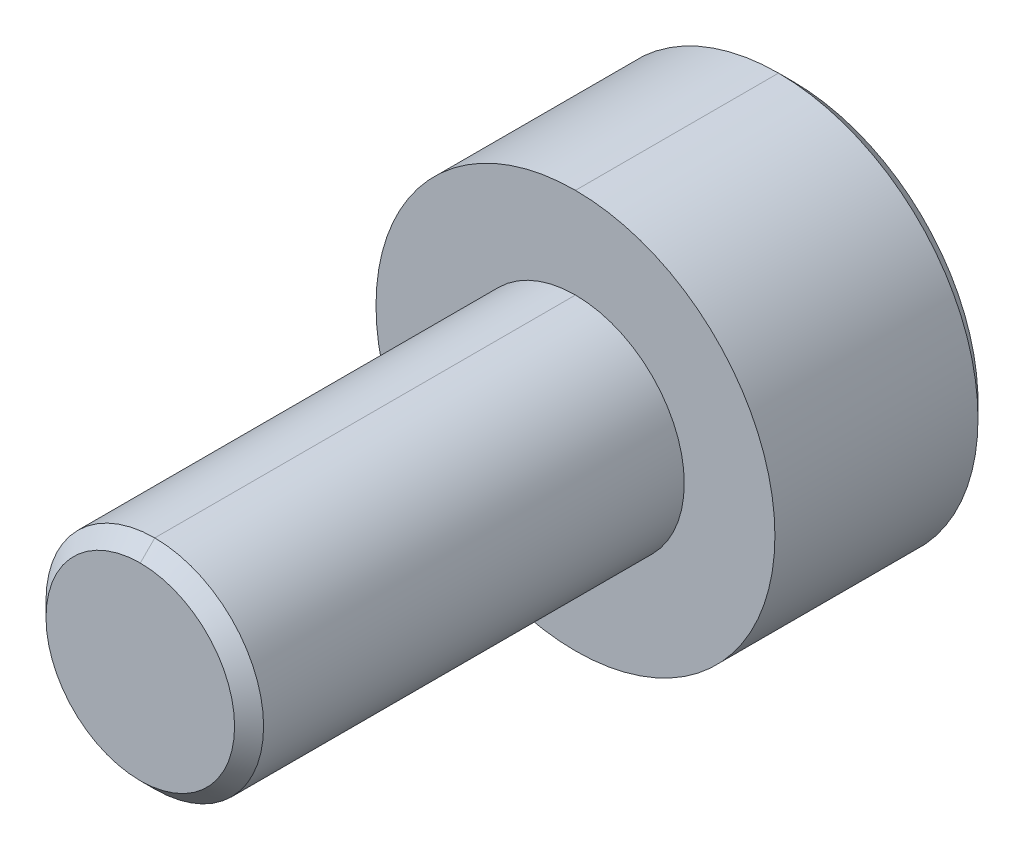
ISO-10303-21;
HEADER;
FILE_DESCRIPTION(('STEP AP214'),'2;1');
FILE_NAME('part.step','',(''),(''),'','','');
FILE_SCHEMA(('AUTOMOTIVE_DESIGN { 1 0 10303 214 1 1 1 1 }'));
ENDSEC;
DATA;
#1=APPLICATION_CONTEXT('core data for automotive mechanical design processes');
#2=APPLICATION_PROTOCOL_DEFINITION('international standard','automotive_design',2000,#1);
#3=PRODUCT_CONTEXT('',#1,'mechanical');
#4=PRODUCT('Part','Part','',(#3));
#5=PRODUCT_RELATED_PRODUCT_CATEGORY('part','',(#4));
#6=PRODUCT_DEFINITION_FORMATION('','',#4);
#7=PRODUCT_DEFINITION_CONTEXT('part definition',#1,'design');
#8=PRODUCT_DEFINITION('design','',#6,#7);
#9=PRODUCT_DEFINITION_SHAPE('','',#8);
#10=(LENGTH_UNIT() NAMED_UNIT(*) SI_UNIT(.MILLI.,.METRE.));
#11=(NAMED_UNIT(*) PLANE_ANGLE_UNIT() SI_UNIT($,.RADIAN.));
#12=(NAMED_UNIT(*) SI_UNIT($,.STERADIAN.) SOLID_ANGLE_UNIT());
#13=UNCERTAINTY_MEASURE_WITH_UNIT(LENGTH_MEASURE(1.E-05),#10,'distance_accuracy_value','');
#14=(GEOMETRIC_REPRESENTATION_CONTEXT(3) GLOBAL_UNCERTAINTY_ASSIGNED_CONTEXT((#13)) GLOBAL_UNIT_ASSIGNED_CONTEXT((#10,
#11,#12)) REPRESENTATION_CONTEXT('',''));
#15=CARTESIAN_POINT('',(0.,0.,0.));
#16=DIRECTION('',(0.,0.,1.));
#17=DIRECTION('',(1.,0.,0.));
#18=AXIS2_PLACEMENT_3D('',#15,#16,#17);
#19=CARTESIAN_POINT('',(0.,9.,-52.3));
#20=DIRECTION('',(0.,0.,-1.));
#21=DIRECTION('',(-1.,0.,0.));
#22=AXIS2_PLACEMENT_3D('',#19,#20,#21);
#23=PLANE('',#22);
#24=DIRECTION('',(-0.50000000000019,0.866025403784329,0.));
#25=VECTOR('',#24,1.);
#26=CARTESIAN_POINT('',(0.721687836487,10.25,-52.3));
#27=LINE('',#26,#25);
#28=CARTESIAN_POINT('',(1.443375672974,9.,-52.3));
#29=VERTEX_POINT('',#28);
#30=CARTESIAN_POINT('',(0.721687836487,10.25,-52.3));
#31=VERTEX_POINT('',#30);
#32=EDGE_CURVE('E193',#29,#31,#27,.T.);
#33=ORIENTED_EDGE('',*,*,#32,.F.);
#34=DIRECTION('',(0.50000000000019,0.866025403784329,0.));
#35=VECTOR('',#34,1.);
#36=CARTESIAN_POINT('',(1.443375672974,9.,-52.3));
#37=LINE('',#36,#35);
#38=CARTESIAN_POINT('',(0.721687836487,7.75,-52.3));
#39=VERTEX_POINT('',#38);
#40=EDGE_CURVE('E10',#39,#29,#37,.T.);
#41=ORIENTED_EDGE('',*,*,#40,.F.);
#42=DIRECTION('',(1.,0.,0.));
#43=VECTOR('',#42,1.);
#44=CARTESIAN_POINT('',(0.721687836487,7.75,-52.3));
#45=LINE('',#44,#43);
#46=CARTESIAN_POINT('',(-0.721687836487,7.75,-52.3));
#47=VERTEX_POINT('',#46);
#48=EDGE_CURVE('E127',#47,#39,#45,.T.);
#49=ORIENTED_EDGE('',*,*,#48,.F.);
#50=DIRECTION('',(0.50000000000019,-0.866025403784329,0.));
#51=VECTOR('',#50,1.);
#52=CARTESIAN_POINT('',(-0.721687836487,7.75,-52.3));
#53=LINE('',#52,#51);
#54=CARTESIAN_POINT('',(-1.443375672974,9.,-52.3));
#55=VERTEX_POINT('',#54);
#56=EDGE_CURVE('E121',#55,#47,#53,.T.);
#57=ORIENTED_EDGE('',*,*,#56,.F.);
#58=DIRECTION('',(-0.50000000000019,-0.866025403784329,0.));
#59=VECTOR('',#58,1.);
#60=CARTESIAN_POINT('',(-1.443375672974,9.,-52.3));
#61=LINE('',#60,#59);
#62=CARTESIAN_POINT('',(-0.721687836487,10.25,-52.3));
#63=VERTEX_POINT('',#62);
#64=EDGE_CURVE('E124',#63,#55,#61,.T.);
#65=ORIENTED_EDGE('',*,*,#64,.F.);
#66=DIRECTION('',(-1.,0.,0.));
#67=VECTOR('',#66,1.);
#68=CARTESIAN_POINT('',(-0.721687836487,10.25,-52.3));
#69=LINE('',#68,#67);
#70=EDGE_CURVE('E151',#31,#63,#69,.T.);
#71=ORIENTED_EDGE('',*,*,#70,.F.);
#72=EDGE_LOOP('',(#33,#41,#49,#57,#65,#71));
#73=FACE_BOUND('',#72,.T.);
#74=ADVANCED_FACE('F16',(#73),#23,.T.);
#75=CARTESIAN_POINT('',(1.443375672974,9.,-52.3));
#76=DIRECTION('',(-0.866025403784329,0.50000000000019,0.));
#77=DIRECTION('',(0.,0.,1.));
#78=AXIS2_PLACEMENT_3D('',#75,#76,#77);
#79=PLANE('',#78);
#80=DIRECTION('',(0.50000000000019,0.866025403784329,0.));
#81=VECTOR('',#80,1.);
#82=CARTESIAN_POINT('',(1.443375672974,9.,-53.8));
#83=LINE('',#82,#81);
#84=CARTESIAN_POINT('',(0.721687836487,7.75,-53.8));
#85=VERTEX_POINT('',#84);
#86=CARTESIAN_POINT('',(1.443375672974,9.,-53.8));
#87=VERTEX_POINT('',#86);
#88=EDGE_CURVE('E238',#85,#87,#83,.T.);
#89=ORIENTED_EDGE('',*,*,#88,.F.);
#90=DIRECTION('',(0.,0.,-1.));
#91=VECTOR('',#90,1.);
#92=CARTESIAN_POINT('',(0.721687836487,7.75,-52.3));
#93=LINE('',#92,#91);
#94=EDGE_CURVE('E27',#39,#85,#93,.T.);
#95=ORIENTED_EDGE('',*,*,#94,.F.);
#96=ORIENTED_EDGE('',*,*,#40,.T.);
#97=DIRECTION('',(0.,0.,-1.));
#98=VECTOR('',#97,1.);
#99=CARTESIAN_POINT('',(1.443375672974,9.,-52.3));
#100=LINE('',#99,#98);
#101=EDGE_CURVE('E212',#29,#87,#100,.T.);
#102=ORIENTED_EDGE('',*,*,#101,.T.);
#103=EDGE_LOOP('',(#89,#95,#96,#102));
#104=FACE_BOUND('',#103,.T.);
#105=ADVANCED_FACE('F272',(#104),#79,.T.);
#106=CARTESIAN_POINT('',(0.721687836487,7.75,-52.3));
#107=DIRECTION('',(0.,1.,0.));
#108=DIRECTION('',(1.,0.,0.));
#109=AXIS2_PLACEMENT_3D('',#106,#107,#108);
#110=PLANE('',#109);
#111=DIRECTION('',(1.,0.,0.));
#112=VECTOR('',#111,1.);
#113=CARTESIAN_POINT('',(0.721687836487,7.75,-53.8));
#114=LINE('',#113,#112);
#115=CARTESIAN_POINT('',(-0.721687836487,7.75,-53.8));
#116=VERTEX_POINT('',#115);
#117=EDGE_CURVE('E186',#116,#85,#114,.T.);
#118=ORIENTED_EDGE('',*,*,#117,.F.);
#119=DIRECTION('',(0.,0.,-1.));
#120=VECTOR('',#119,1.);
#121=CARTESIAN_POINT('',(-0.721687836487,7.75,-52.3));
#122=LINE('',#121,#120);
#123=EDGE_CURVE('E131',#47,#116,#122,.T.);
#124=ORIENTED_EDGE('',*,*,#123,.F.);
#125=ORIENTED_EDGE('',*,*,#48,.T.);
#126=ORIENTED_EDGE('',*,*,#94,.T.);
#127=EDGE_LOOP('',(#118,#124,#125,#126));
#128=FACE_BOUND('',#127,.T.);
#129=ADVANCED_FACE('F265',(#128),#110,.T.);
#130=CARTESIAN_POINT('',(-0.721687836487,7.75,-52.3));
#131=DIRECTION('',(0.866025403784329,0.50000000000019,0.));
#132=DIRECTION('',(0.,0.,-1.));
#133=AXIS2_PLACEMENT_3D('',#130,#131,#132);
#134=PLANE('',#133);
#135=DIRECTION('',(0.50000000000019,-0.866025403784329,0.));
#136=VECTOR('',#135,1.);
#137=CARTESIAN_POINT('',(-0.721687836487,7.75,-53.8));
#138=LINE('',#137,#136);
#139=CARTESIAN_POINT('',(-1.443375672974,9.,-53.8));
#140=VERTEX_POINT('',#139);
#141=EDGE_CURVE('E137',#140,#116,#138,.T.);
#142=ORIENTED_EDGE('',*,*,#141,.F.);
#143=DIRECTION('',(0.,0.,-1.));
#144=VECTOR('',#143,1.);
#145=CARTESIAN_POINT('',(-1.443375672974,9.,-52.3));
#146=LINE('',#145,#144);
#147=EDGE_CURVE('E132',#55,#140,#146,.T.);
#148=ORIENTED_EDGE('',*,*,#147,.F.);
#149=ORIENTED_EDGE('',*,*,#56,.T.);
#150=ORIENTED_EDGE('',*,*,#123,.T.);
#151=EDGE_LOOP('',(#142,#148,#149,#150));
#152=FACE_BOUND('',#151,.T.);
#153=ADVANCED_FACE('F135',(#152),#134,.T.);
#154=CARTESIAN_POINT('',(-1.443375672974,9.,-52.3));
#155=DIRECTION('',(0.866025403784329,-0.50000000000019,0.));
#156=DIRECTION('',(0.,0.,-1.));
#157=AXIS2_PLACEMENT_3D('',#154,#155,#156);
#158=PLANE('',#157);
#159=DIRECTION('',(-0.50000000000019,-0.866025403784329,0.));
#160=VECTOR('',#159,1.);
#161=CARTESIAN_POINT('',(-1.443375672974,9.,-53.8));
#162=LINE('',#161,#160);
#163=CARTESIAN_POINT('',(-0.721687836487,10.25,-53.8));
#164=VERTEX_POINT('',#163);
#165=EDGE_CURVE('E157',#164,#140,#162,.T.);
#166=ORIENTED_EDGE('',*,*,#165,.F.);
#167=DIRECTION('',(0.,0.,-1.));
#168=VECTOR('',#167,1.);
#169=CARTESIAN_POINT('',(-0.721687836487,10.25,-52.3));
#170=LINE('',#169,#168);
#171=EDGE_CURVE('E144',#63,#164,#170,.T.);
#172=ORIENTED_EDGE('',*,*,#171,.F.);
#173=ORIENTED_EDGE('',*,*,#64,.T.);
#174=ORIENTED_EDGE('',*,*,#147,.T.);
#175=EDGE_LOOP('',(#166,#172,#173,#174));
#176=FACE_BOUND('',#175,.T.);
#177=ADVANCED_FACE('F143',(#176),#158,.T.);
#178=CARTESIAN_POINT('',(-0.721687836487,10.25,-52.3));
#179=DIRECTION('',(0.,-1.,0.));
#180=DIRECTION('',(0.,0.,-1.));
#181=AXIS2_PLACEMENT_3D('',#178,#179,#180);
#182=PLANE('',#181);
#183=DIRECTION('',(-1.,0.,0.));
#184=VECTOR('',#183,1.);
#185=CARTESIAN_POINT('',(-0.721687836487,10.25,-53.8));
#186=LINE('',#185,#184);
#187=CARTESIAN_POINT('',(0.721687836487,10.25,-53.8));
#188=VERTEX_POINT('',#187);
#189=EDGE_CURVE('E154',#188,#164,#186,.T.);
#190=ORIENTED_EDGE('',*,*,#189,.F.);
#191=DIRECTION('',(0.,0.,-1.));
#192=VECTOR('',#191,1.);
#193=CARTESIAN_POINT('',(0.721687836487,10.25,-52.3));
#194=LINE('',#193,#192);
#195=EDGE_CURVE('E183',#31,#188,#194,.T.);
#196=ORIENTED_EDGE('',*,*,#195,.F.);
#197=ORIENTED_EDGE('',*,*,#70,.T.);
#198=ORIENTED_EDGE('',*,*,#171,.T.);
#199=EDGE_LOOP('',(#190,#196,#197,#198));
#200=FACE_BOUND('',#199,.T.);
#201=ADVANCED_FACE('F356',(#200),#182,.T.);
#202=CARTESIAN_POINT('',(0.721687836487,10.25,-52.3));
#203=DIRECTION('',(-0.866025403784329,-0.50000000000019,0.));
#204=DIRECTION('',(-0.50000000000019,0.866025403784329,0.));
#205=AXIS2_PLACEMENT_3D('',#202,#203,#204);
#206=PLANE('',#205);
#207=DIRECTION('',(-0.50000000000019,0.866025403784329,0.));
#208=VECTOR('',#207,1.);
#209=CARTESIAN_POINT('',(0.721687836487,10.25,-53.8));
#210=LINE('',#209,#208);
#211=EDGE_CURVE('E20',#87,#188,#210,.T.);
#212=ORIENTED_EDGE('',*,*,#211,.F.);
#213=ORIENTED_EDGE('',*,*,#101,.F.);
#214=ORIENTED_EDGE('',*,*,#32,.T.);
#215=ORIENTED_EDGE('',*,*,#195,.T.);
#216=EDGE_LOOP('',(#212,#213,#214,#215));
#217=FACE_BOUND('',#216,.T.);
#218=ADVANCED_FACE('F276',(#217),#206,.T.);
#219=CARTESIAN_POINT('',(1.3,9.,-44.8));
#220=DIRECTION('',(0.,0.,1.));
#221=DIRECTION('',(1.,0.,0.));
#222=AXIS2_PLACEMENT_3D('',#219,#220,#221);
#223=PLANE('',#222);
#224=CARTESIAN_POINT('',(0.,9.,-44.8));
#225=DIRECTION('',(0.,0.,-1.));
#226=DIRECTION('',(0.,1.,0.));
#227=AXIS2_PLACEMENT_3D('',#224,#225,#226);
#228=CIRCLE('',#227,1.3);
#229=CARTESIAN_POINT('',(0.,10.3,-44.8));
#230=VERTEX_POINT('',#229);
#231=CARTESIAN_POINT('',(0.,7.7,-44.8));
#232=VERTEX_POINT('',#231);
#233=EDGE_CURVE('E195',#230,#232,#228,.T.);
#234=ORIENTED_EDGE('',*,*,#233,.F.);
#235=CARTESIAN_POINT('',(0.,9.,-44.8));
#236=DIRECTION('',(0.,0.,-1.));
#237=DIRECTION('',(0.,1.,0.));
#238=AXIS2_PLACEMENT_3D('',#235,#236,#237);
#239=CIRCLE('',#238,1.3);
#240=EDGE_CURVE('E191',#232,#230,#239,.T.);
#241=ORIENTED_EDGE('',*,*,#240,.F.);
#242=EDGE_LOOP('',(#234,#241));
#243=FACE_BOUND('',#242,.T.);
#244=ADVANCED_FACE('F18',(#243),#223,.T.);
#245=CARTESIAN_POINT('',(0.,9.,-45.));
#246=DIRECTION('',(0.,0.,-1.));
#247=DIRECTION('',(0.,1.,0.));
#248=AXIS2_PLACEMENT_3D('',#245,#246,#247);
#249=CONICAL_SURFACE('',#248,1.5,0.785398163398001);
#250=DIRECTION('',(0.,-0.707106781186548,-0.707106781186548));
#251=VECTOR('',#250,1.);
#252=CARTESIAN_POINT('',(0.,7.5,-45.));
#253=LINE('',#252,#251);
#254=CARTESIAN_POINT('',(0.,7.5,-45.));
#255=VERTEX_POINT('',#254);
#256=EDGE_CURVE('E180',#232,#255,#253,.T.);
#257=ORIENTED_EDGE('',*,*,#256,.F.);
#258=ORIENTED_EDGE('',*,*,#240,.T.);
#259=DIRECTION('',(0.,0.707106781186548,-0.707106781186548));
#260=VECTOR('',#259,1.);
#261=CARTESIAN_POINT('',(0.,10.5,-45.));
#262=LINE('',#261,#260);
#263=CARTESIAN_POINT('',(0.,10.5,-45.));
#264=VERTEX_POINT('',#263);
#265=EDGE_CURVE('E179',#230,#264,#262,.T.);
#266=ORIENTED_EDGE('',*,*,#265,.T.);
#267=CARTESIAN_POINT('',(0.,9.,-45.));
#268=DIRECTION('',(0.,0.,-1.));
#269=DIRECTION('',(0.,1.,0.));
#270=AXIS2_PLACEMENT_3D('',#267,#268,#269);
#271=CIRCLE('',#270,1.5);
#272=EDGE_CURVE('E187',#255,#264,#271,.T.);
#273=ORIENTED_EDGE('',*,*,#272,.F.);
#274=EDGE_LOOP('',(#257,#258,#266,#273));
#275=FACE_BOUND('',#274,.T.);
#276=ADVANCED_FACE('F283',(#275),#249,.T.);
#277=CARTESIAN_POINT('',(-1.011769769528E-13,9.,-550.8));
#278=DIRECTION('',(0.,0.,-1.));
#279=DIRECTION('',(0.,1.,0.));
#280=AXIS2_PLACEMENT_3D('',#277,#278,#279);
#281=CYLINDRICAL_SURFACE('',#280,1.5);
#282=DIRECTION('',(0.,0.,-1.));
#283=VECTOR('',#282,1.);
#284=CARTESIAN_POINT('',(-1.009932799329E-13,7.5,-550.8));
#285=LINE('',#284,#283);
#286=CARTESIAN_POINT('',(0.,7.5,-50.8));
#287=VERTEX_POINT('',#286);
#288=EDGE_CURVE('E199',#255,#287,#285,.T.);
#289=ORIENTED_EDGE('',*,*,#288,.F.);
#290=ORIENTED_EDGE('',*,*,#272,.T.);
#291=DIRECTION('',(0.,0.,-1.));
#292=VECTOR('',#291,1.);
#293=CARTESIAN_POINT('',(-1.011769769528E-13,10.5,-550.8));
#294=LINE('',#293,#292);
#295=CARTESIAN_POINT('',(0.,10.5,-50.8));
#296=VERTEX_POINT('',#295);
#297=EDGE_CURVE('E174',#264,#296,#294,.T.);
#298=ORIENTED_EDGE('',*,*,#297,.T.);
#299=CARTESIAN_POINT('',(0.,9.,-50.8));
#300=DIRECTION('',(0.,0.,-1.));
#301=DIRECTION('',(0.,1.,0.));
#302=AXIS2_PLACEMENT_3D('',#299,#300,#301);
#303=CIRCLE('',#302,1.5);
#304=EDGE_CURVE('E161',#287,#296,#303,.T.);
#305=ORIENTED_EDGE('',*,*,#304,.F.);
#306=EDGE_LOOP('',(#289,#290,#298,#305));
#307=FACE_BOUND('',#306,.T.);
#308=ADVANCED_FACE('F288',(#307),#281,.T.);
#309=CARTESIAN_POINT('',(2.75,9.,-50.8));
#310=DIRECTION('',(0.,0.,1.));
#311=DIRECTION('',(1.,0.,0.));
#312=AXIS2_PLACEMENT_3D('',#309,#310,#311);
#313=PLANE('',#312);
#314=CARTESIAN_POINT('',(0.,9.,-50.8));
#315=DIRECTION('',(0.,0.,-1.));
#316=DIRECTION('',(0.,1.,0.));
#317=AXIS2_PLACEMENT_3D('',#314,#315,#316);
#318=CIRCLE('',#317,2.75);
#319=CARTESIAN_POINT('',(0.,11.75,-50.8));
#320=VERTEX_POINT('',#319);
#321=CARTESIAN_POINT('',(0.,6.25,-50.8));
#322=VERTEX_POINT('',#321);
#323=EDGE_CURVE('E169',#320,#322,#318,.T.);
#324=ORIENTED_EDGE('',*,*,#323,.F.);
#325=CARTESIAN_POINT('',(0.,9.,-50.8));
#326=DIRECTION('',(0.,0.,-1.));
#327=DIRECTION('',(0.,1.,0.));
#328=AXIS2_PLACEMENT_3D('',#325,#326,#327);
#329=CIRCLE('',#328,2.75);
#330=EDGE_CURVE('E158',#322,#320,#329,.T.);
#331=ORIENTED_EDGE('',*,*,#330,.F.);
#332=EDGE_LOOP('',(#324,#331));
#333=FACE_BOUND('',#332,.T.);
#334=CARTESIAN_POINT('',(0.,9.,-50.8));
#335=DIRECTION('',(0.,0.,-1.));
#336=DIRECTION('',(0.,1.,0.));
#337=AXIS2_PLACEMENT_3D('',#334,#335,#336);
#338=CIRCLE('',#337,1.5);
#339=EDGE_CURVE('E203',#296,#287,#338,.T.);
#340=ORIENTED_EDGE('',*,*,#339,.T.);
#341=ORIENTED_EDGE('',*,*,#304,.T.);
#342=EDGE_LOOP('',(#340,#341));
#343=FACE_BOUND('',#342,.T.);
#344=ADVANCED_FACE('F373',(#333,#343),#313,.T.);
#345=CARTESIAN_POINT('',(-1.011769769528E-13,9.,-550.8));
#346=DIRECTION('',(0.,0.,-1.));
#347=DIRECTION('',(0.,1.,0.));
#348=AXIS2_PLACEMENT_3D('',#345,#346,#347);
#349=CYLINDRICAL_SURFACE('',#348,2.75);
#350=DIRECTION('',(0.,0.,-1.));
#351=VECTOR('',#350,1.);
#352=CARTESIAN_POINT('',(-1.00840199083E-13,6.25,-550.8));
#353=LINE('',#352,#351);
#354=CARTESIAN_POINT('',(0.,6.25,-53.6));
#355=VERTEX_POINT('',#354);
#356=EDGE_CURVE('E173',#322,#355,#353,.T.);
#357=ORIENTED_EDGE('',*,*,#356,.F.);
#358=ORIENTED_EDGE('',*,*,#330,.T.);
#359=DIRECTION('',(0.,0.,-1.));
#360=VECTOR('',#359,1.);
#361=CARTESIAN_POINT('',(-1.011769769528E-13,11.75,-550.8));
#362=LINE('',#361,#360);
#363=CARTESIAN_POINT('',(0.,11.75,-53.6));
#364=VERTEX_POINT('',#363);
#365=EDGE_CURVE('E216',#320,#364,#362,.T.);
#366=ORIENTED_EDGE('',*,*,#365,.T.);
#367=CARTESIAN_POINT('',(0.,9.,-53.6));
#368=DIRECTION('',(0.,0.,-1.));
#369=DIRECTION('',(0.,1.,0.));
#370=AXIS2_PLACEMENT_3D('',#367,#368,#369);
#371=CIRCLE('',#370,2.75);
#372=EDGE_CURVE('E162',#355,#364,#371,.T.);
#373=ORIENTED_EDGE('',*,*,#372,.F.);
#374=EDGE_LOOP('',(#357,#358,#366,#373));
#375=FACE_BOUND('',#374,.T.);
#376=ADVANCED_FACE('F336',(#375),#349,.T.);
#377=CARTESIAN_POINT('',(0.,9.,-53.8));
#378=DIRECTION('',(0.,0.,1.));
#379=DIRECTION('',(0.,-1.,0.));
#380=AXIS2_PLACEMENT_3D('',#377,#378,#379);
#381=CONICAL_SURFACE('',#380,2.55,0.785398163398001);
#382=DIRECTION('',(0.,0.707106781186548,0.707106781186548));
#383=VECTOR('',#382,1.);
#384=CARTESIAN_POINT('',(0.,11.55,-53.8));
#385=LINE('',#384,#383);
#386=CARTESIAN_POINT('',(0.,11.55,-53.8));
#387=VERTEX_POINT('',#386);
#388=EDGE_CURVE('E163',#387,#364,#385,.T.);
#389=ORIENTED_EDGE('',*,*,#388,.F.);
#390=CARTESIAN_POINT('',(0.,9.,-53.8));
#391=DIRECTION('',(0.,0.,-1.));
#392=DIRECTION('',(0.,1.,0.));
#393=AXIS2_PLACEMENT_3D('',#390,#391,#392);
#394=CIRCLE('',#393,2.55);
#395=CARTESIAN_POINT('',(0.,6.45,-53.8));
#396=VERTEX_POINT('',#395);
#397=EDGE_CURVE('E236',#396,#387,#394,.T.);
#398=ORIENTED_EDGE('',*,*,#397,.F.);
#399=DIRECTION('',(0.,-0.707106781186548,0.707106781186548));
#400=VECTOR('',#399,1.);
#401=CARTESIAN_POINT('',(0.,6.45,-53.8));
#402=LINE('',#401,#400);
#403=EDGE_CURVE('E167',#396,#355,#402,.T.);
#404=ORIENTED_EDGE('',*,*,#403,.T.);
#405=ORIENTED_EDGE('',*,*,#372,.T.);
#406=EDGE_LOOP('',(#389,#398,#404,#405));
#407=FACE_BOUND('',#406,.T.);
#408=ADVANCED_FACE('F331',(#407),#381,.T.);
#409=CARTESIAN_POINT('',(0.,9.,-53.8));
#410=DIRECTION('',(0.,0.,-1.));
#411=DIRECTION('',(-1.,0.,0.));
#412=AXIS2_PLACEMENT_3D('',#409,#410,#411);
#413=PLANE('',#412);
#414=ORIENTED_EDGE('',*,*,#88,.T.);
#415=ORIENTED_EDGE('',*,*,#211,.T.);
#416=ORIENTED_EDGE('',*,*,#189,.T.);
#417=ORIENTED_EDGE('',*,*,#165,.T.);
#418=ORIENTED_EDGE('',*,*,#141,.T.);
#419=ORIENTED_EDGE('',*,*,#117,.T.);
#420=EDGE_LOOP('',(#414,#415,#416,#417,#418,#419));
#421=FACE_BOUND('',#420,.T.);
#422=ORIENTED_EDGE('',*,*,#397,.T.);
#423=CARTESIAN_POINT('',(0.,9.,-53.8));
#424=DIRECTION('',(0.,0.,-1.));
#425=DIRECTION('',(0.,1.,0.));
#426=AXIS2_PLACEMENT_3D('',#423,#424,#425);
#427=CIRCLE('',#426,2.55);
#428=EDGE_CURVE('E168',#387,#396,#427,.T.);
#429=ORIENTED_EDGE('',*,*,#428,.T.);
#430=EDGE_LOOP('',(#422,#429));
#431=FACE_BOUND('',#430,.T.);
#432=ADVANCED_FACE('F269',(#421,#431),#413,.T.);
#433=CARTESIAN_POINT('',(0.,9.,-53.8));
#434=DIRECTION('',(0.,0.,1.));
#435=DIRECTION('',(0.,-1.,0.));
#436=AXIS2_PLACEMENT_3D('',#433,#434,#435);
#437=CONICAL_SURFACE('',#436,2.55,0.785398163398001);
#438=ORIENTED_EDGE('',*,*,#428,.F.);
#439=ORIENTED_EDGE('',*,*,#388,.T.);
#440=CARTESIAN_POINT('',(0.,9.,-53.6));
#441=DIRECTION('',(0.,0.,-1.));
#442=DIRECTION('',(0.,1.,0.));
#443=AXIS2_PLACEMENT_3D('',#440,#441,#442);
#444=CIRCLE('',#443,2.75);
#445=EDGE_CURVE('E217',#364,#355,#444,.T.);
#446=ORIENTED_EDGE('',*,*,#445,.T.);
#447=ORIENTED_EDGE('',*,*,#403,.F.);
#448=EDGE_LOOP('',(#438,#439,#446,#447));
#449=FACE_BOUND('',#448,.T.);
#450=ADVANCED_FACE('F303',(#449),#437,.T.);
#451=CARTESIAN_POINT('',(-1.011769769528E-13,9.,-550.8));
#452=DIRECTION('',(0.,0.,-1.));
#453=DIRECTION('',(0.,1.,0.));
#454=AXIS2_PLACEMENT_3D('',#451,#452,#453);
#455=CYLINDRICAL_SURFACE('',#454,2.75);
#456=ORIENTED_EDGE('',*,*,#323,.T.);
#457=ORIENTED_EDGE('',*,*,#356,.T.);
#458=ORIENTED_EDGE('',*,*,#445,.F.);
#459=ORIENTED_EDGE('',*,*,#365,.F.);
#460=EDGE_LOOP('',(#456,#457,#458,#459));
#461=FACE_BOUND('',#460,.T.);
#462=ADVANCED_FACE('F297',(#461),#455,.T.);
#463=CARTESIAN_POINT('',(-1.011769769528E-13,9.,-550.8));
#464=DIRECTION('',(0.,0.,-1.));
#465=DIRECTION('',(0.,1.,0.));
#466=AXIS2_PLACEMENT_3D('',#463,#464,#465);
#467=CYLINDRICAL_SURFACE('',#466,1.5);
#468=CARTESIAN_POINT('',(0.,9.,-45.));
#469=DIRECTION('',(0.,0.,-1.));
#470=DIRECTION('',(0.,1.,0.));
#471=AXIS2_PLACEMENT_3D('',#468,#469,#470);
#472=CIRCLE('',#471,1.5);
#473=EDGE_CURVE('E175',#264,#255,#472,.T.);
#474=ORIENTED_EDGE('',*,*,#473,.T.);
#475=ORIENTED_EDGE('',*,*,#288,.T.);
#476=ORIENTED_EDGE('',*,*,#339,.F.);
#477=ORIENTED_EDGE('',*,*,#297,.F.);
#478=EDGE_LOOP('',(#474,#475,#476,#477));
#479=FACE_BOUND('',#478,.T.);
#480=ADVANCED_FACE('F302',(#479),#467,.T.);
#481=CARTESIAN_POINT('',(0.,9.,-45.));
#482=DIRECTION('',(0.,0.,-1.));
#483=DIRECTION('',(0.,1.,0.));
#484=AXIS2_PLACEMENT_3D('',#481,#482,#483);
#485=CONICAL_SURFACE('',#484,1.5,0.785398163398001);
#486=ORIENTED_EDGE('',*,*,#233,.T.);
#487=ORIENTED_EDGE('',*,*,#256,.T.);
#488=ORIENTED_EDGE('',*,*,#473,.F.);
#489=ORIENTED_EDGE('',*,*,#265,.F.);
#490=EDGE_LOOP('',(#486,#487,#488,#489));
#491=FACE_BOUND('',#490,.T.);
#492=ADVANCED_FACE('F314',(#491),#485,.T.);
#493=CLOSED_SHELL('',(#74,#105,#129,#153,#177,#201,#218,#244,#276,#308,#344,#376,#408,#432,#450,
#462,#480,#492));
#494=MANIFOLD_SOLID_BREP('B1',#493);
#495=ADVANCED_BREP_SHAPE_REPRESENTATION('',(#18,#494),#14);
#496=SHAPE_DEFINITION_REPRESENTATION(#9,#495);
ENDSEC;
END-ISO-10303-21;
